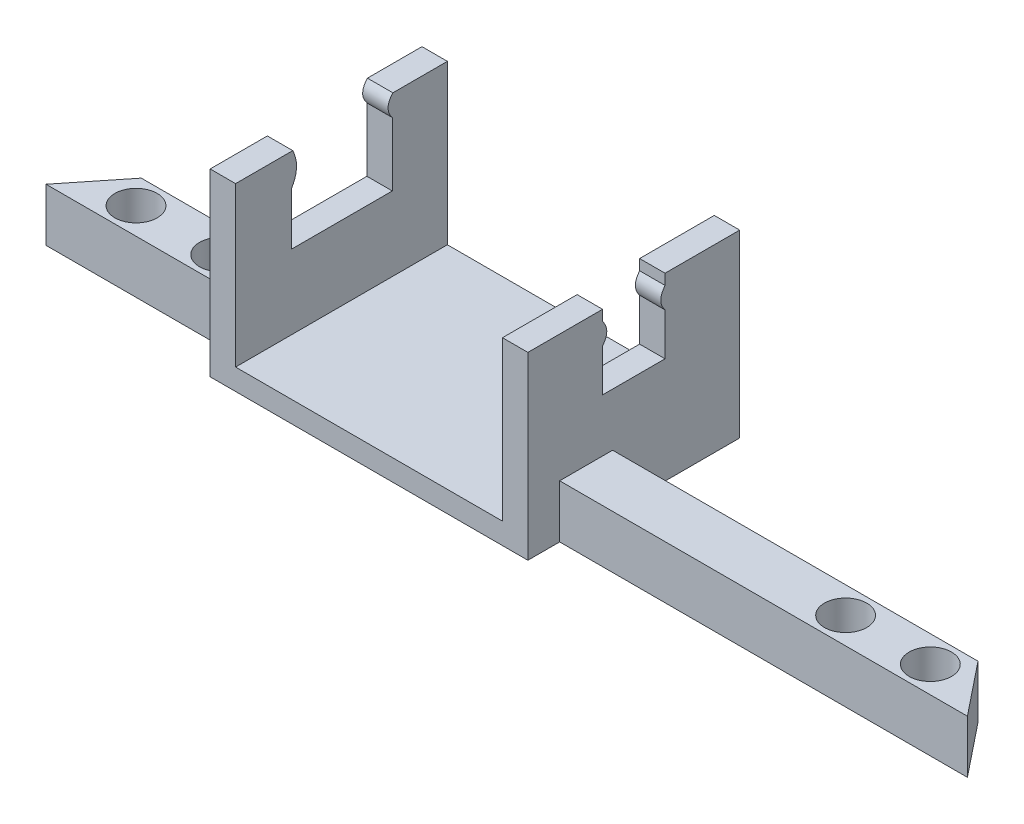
from build123d import *

# Parameters (mm, degrees)
SKETCH_1_W          = 30
SKETCH_1_H          = 20
EXTRUDE_1_DEPTH     = 2
EXTRUDE_2_DEPTH     = 2.4
EXTRUDE_3_DEPTH     = 2.4
SKETCH_4_R          = 2
EXTRUDE_4_DEPTH     = 5
SKETCH_5_W          = 25.2
SKETCH_5_H          = 5
CUT_EXTRUDE_1_DEPTH = 3


with BuildPart() as part:
    # Sketch 1 → Extrude 1 (new body)
    with BuildSketch(Plane(origin=(0, 0, 0), x_dir=(1, 0, 0), z_dir=(0, 1, 0))):
        Rectangle(SKETCH_1_W, SKETCH_1_H)
    extrude(amount=EXTRUDE_1_DEPTH)

    # Sketch 3 → Extrude 3 (add)
    with BuildSketch(Plane(origin=(15, 0, 0), x_dir=(0, 0, -1), z_dir=(1, 0, 0))):
        with BuildLine():
            Line((-10, 2), (10, 2))
            Line((10, 2), (10, 17))
            Line((10, 17), (2.95, 17))
            Line((2.95, 17), (2.95, 16))
            add(Edge.make_bspline(
                [(2.95, 16), (2.15, 15), (2.95, 14)],
                knots=[0, 0, 0, 1, 1, 1], degree=2))
            Line((2.95, 14), (2.95, 10))
            Line((2.95, 10), (-2.95, 10))
            Line((-2.95, 10), (-2.95, 14))
            add(Edge.make_bspline(
                [(-2.95, 16), (-2.15, 15), (-2.95, 14)],
                knots=[0, 0, 0, 1, 1, 1], degree=2))
            Line((-2.95, 16), (-2.95, 17))
            Line((-2.95, 17), (-10, 17))
            Line((-10, 17), (-10, 2))
        make_face()
    extrude(amount=-EXTRUDE_3_DEPTH)



with BuildPart() as body_2:
    # Sketch 2 → Extrude 2 (new body)
    with BuildSketch(Plane.ZY.offset(15)):
        with BuildLine():
            Line((-10, 2), (10, 2))
            Line((10, 2), (10, 17))
            Line((10, 17), (4.6, 17))
            add(Edge.make_bspline(
                [(4.6, 17), (3.844570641, 15.406305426), (4.7, 14)],
                knots=[0, 0, 0, 1, 1, 1], degree=2))
            Line((4.7, 14), (4.7, 9.000156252))
            Line((4.7, 9.000156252), (-4.8, 9.000156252))
            Line((-4.8, 9.000156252), (-4.8, 15.000625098))
            add(Edge.make_bspline(
                [(-4.85, 17), (-3.97537194, 16.018404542), (-4.8, 15.000625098)],
                knots=[0, 0, 0, 1, 1, 1], degree=2))
            Line((-4.85, 17), (-10, 17))
            Line((-10, 17), (-10, 2))
        make_face()
    extrude(amount=-EXTRUDE_2_DEPTH)


with BuildPart() as part_1:
    add(part.part)

    add(body_2.part)  # Extrude 4 merges body 2
    # Sketch 4 → Extrude 4 (add)
    with BuildSketch(Plane.XZ):
        Polygon((-29.5, 2), (49.5, 2), (53.5, 7), (-33.5, 7), align=None)
        with Locations(Location((-27.5, 4.5, 0), (0, 0, 270))):
            Circle(SKETCH_4_R, mode=Mode.SUBTRACT)
        with Locations(Location((47.5, 4.5, 0), (0, 0, 270))):
            Circle(SKETCH_4_R, mode=Mode.SUBTRACT)
        with Locations(Location((-19.5, 4.5, 0), (0, 0, 270))):
            Circle(SKETCH_4_R, mode=Mode.SUBTRACT)
        with Locations(Location((39.5, 4.5, 0), (0, 0, 270))):
            Circle(SKETCH_4_R, mode=Mode.SUBTRACT)
    extrude(amount=-EXTRUDE_4_DEPTH)

    # Sketch 5 → Cut-Extrude 1 (cut)
    with BuildSketch(Plane(origin=(0, 5, 0), x_dir=(1, 0, 0), z_dir=(0, 1, 0))):
        with Locations((0, -4.5)):
            Rectangle(SKETCH_5_W, SKETCH_5_H)
    extrude(amount=-CUT_EXTRUDE_1_DEPTH, mode=Mode.SUBTRACT)


solid = part_1.part
